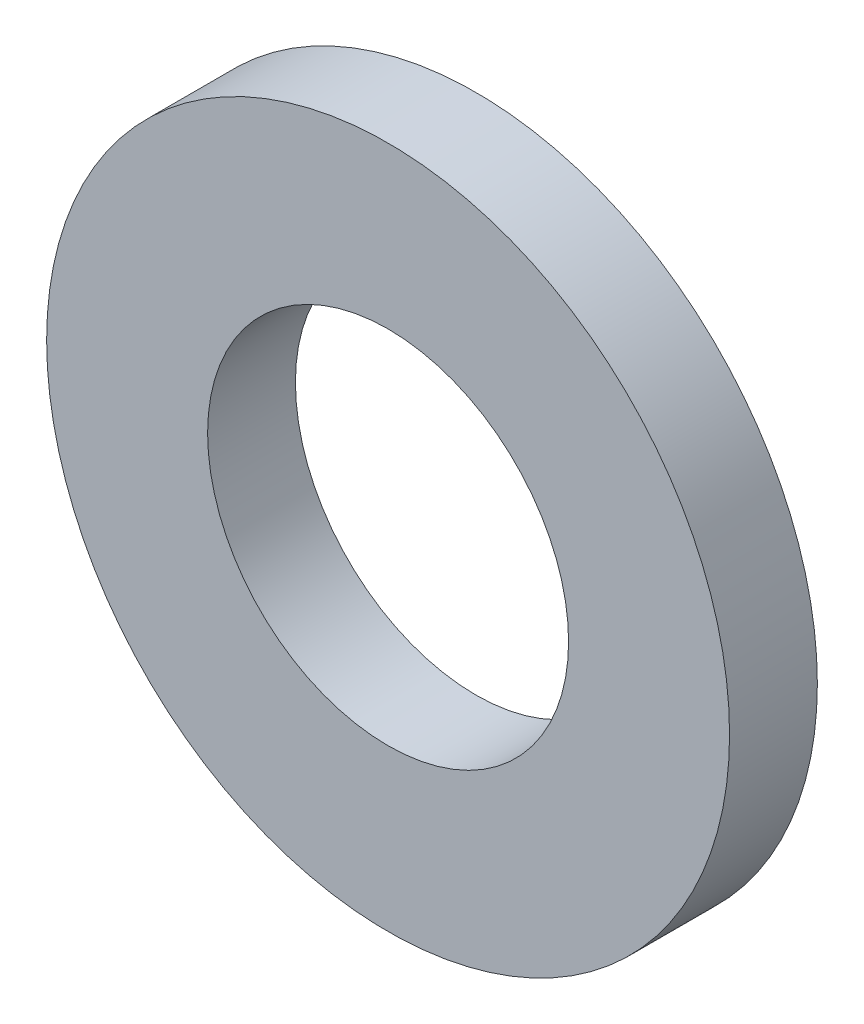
ISO-10303-21;
HEADER;
FILE_DESCRIPTION(('STEP AP214'),'2;1');
FILE_NAME('part.step','',(''),(''),'','','');
FILE_SCHEMA(('AUTOMOTIVE_DESIGN { 1 0 10303 214 1 1 1 1 }'));
ENDSEC;
DATA;
#1=APPLICATION_CONTEXT('core data for automotive mechanical design processes');
#2=APPLICATION_PROTOCOL_DEFINITION('international standard','automotive_design',2000,#1);
#3=PRODUCT_CONTEXT('',#1,'mechanical');
#4=PRODUCT('Part','Part','',(#3));
#5=PRODUCT_RELATED_PRODUCT_CATEGORY('part','',(#4));
#6=PRODUCT_DEFINITION_FORMATION('','',#4);
#7=PRODUCT_DEFINITION_CONTEXT('part definition',#1,'design');
#8=PRODUCT_DEFINITION('design','',#6,#7);
#9=PRODUCT_DEFINITION_SHAPE('','',#8);
#10=(LENGTH_UNIT() NAMED_UNIT(*) SI_UNIT(.MILLI.,.METRE.));
#11=(NAMED_UNIT(*) PLANE_ANGLE_UNIT() SI_UNIT($,.RADIAN.));
#12=(NAMED_UNIT(*) SI_UNIT($,.STERADIAN.) SOLID_ANGLE_UNIT());
#13=UNCERTAINTY_MEASURE_WITH_UNIT(LENGTH_MEASURE(1.E-05),#10,'distance_accuracy_value','');
#14=(GEOMETRIC_REPRESENTATION_CONTEXT(3) GLOBAL_UNCERTAINTY_ASSIGNED_CONTEXT((#13)) GLOBAL_UNIT_ASSIGNED_CONTEXT((#10,
#11,#12)) REPRESENTATION_CONTEXT('',''));
#15=CARTESIAN_POINT('',(0.,0.,0.));
#16=DIRECTION('',(0.,0.,1.));
#17=DIRECTION('',(1.,0.,0.));
#18=AXIS2_PLACEMENT_3D('',#15,#16,#17);
#19=CARTESIAN_POINT('',(0.,0.,1.8));
#20=DIRECTION('',(0.,0.,1.));
#21=DIRECTION('',(1.,0.,0.));
#22=AXIS2_PLACEMENT_3D('',#19,#20,#21);
#23=PLANE('',#22);
#24=CARTESIAN_POINT('',(0.,0.,1.8));
#25=DIRECTION('',(0.,0.,1.));
#26=DIRECTION('',(1.,0.,0.));
#27=AXIS2_PLACEMENT_3D('',#24,#25,#26);
#28=CIRCLE('',#27,7.);
#29=CARTESIAN_POINT('',(7.,0.,1.8));
#30=VERTEX_POINT('',#29);
#31=EDGE_CURVE('E10',#30,#30,#28,.T.);
#32=ORIENTED_EDGE('',*,*,#31,.T.);
#33=EDGE_LOOP('',(#32));
#34=FACE_BOUND('',#33,.T.);
#35=CARTESIAN_POINT('',(0.,0.,1.8));
#36=DIRECTION('',(0.,0.,1.));
#37=DIRECTION('',(1.,0.,0.));
#38=AXIS2_PLACEMENT_3D('',#35,#36,#37);
#39=CIRCLE('',#38,3.7);
#40=CARTESIAN_POINT('',(3.7,0.,1.8));
#41=VERTEX_POINT('',#40);
#42=EDGE_CURVE('E53',#41,#41,#39,.T.);
#43=ORIENTED_EDGE('',*,*,#42,.F.);
#44=EDGE_LOOP('',(#43));
#45=FACE_BOUND('',#44,.T.);
#46=ADVANCED_FACE('F39',(#34,#45),#23,.T.);
#47=CARTESIAN_POINT('',(0.,0.,0.));
#48=DIRECTION('',(0.,0.,1.));
#49=DIRECTION('',(1.,0.,0.));
#50=AXIS2_PLACEMENT_3D('',#47,#48,#49);
#51=PLANE('',#50);
#52=CARTESIAN_POINT('',(0.,0.,0.));
#53=DIRECTION('',(0.,0.,1.));
#54=DIRECTION('',(1.,0.,0.));
#55=AXIS2_PLACEMENT_3D('',#52,#53,#54);
#56=CIRCLE('',#55,7.);
#57=CARTESIAN_POINT('',(7.,0.,0.));
#58=VERTEX_POINT('',#57);
#59=EDGE_CURVE('E43',#58,#58,#56,.T.);
#60=ORIENTED_EDGE('',*,*,#59,.F.);
#61=EDGE_LOOP('',(#60));
#62=FACE_BOUND('',#61,.T.);
#63=CARTESIAN_POINT('',(0.,0.,0.));
#64=DIRECTION('',(0.,0.,1.));
#65=DIRECTION('',(1.,0.,0.));
#66=AXIS2_PLACEMENT_3D('',#63,#64,#65);
#67=CIRCLE('',#66,3.7);
#68=CARTESIAN_POINT('',(3.7,0.,0.));
#69=VERTEX_POINT('',#68);
#70=EDGE_CURVE('E55',#69,#69,#67,.T.);
#71=ORIENTED_EDGE('',*,*,#70,.T.);
#72=EDGE_LOOP('',(#71));
#73=FACE_BOUND('',#72,.T.);
#74=ADVANCED_FACE('F68',(#62,#73),#51,.F.);
#75=CARTESIAN_POINT('',(0.,0.,1.8));
#76=DIRECTION('',(0.,0.,-1.));
#77=DIRECTION('',(-1.,0.,0.));
#78=AXIS2_PLACEMENT_3D('',#75,#76,#77);
#79=CYLINDRICAL_SURFACE('',#78,7.);
#80=ORIENTED_EDGE('',*,*,#31,.F.);
#81=EDGE_LOOP('',(#80));
#82=FACE_BOUND('',#81,.T.);
#83=ORIENTED_EDGE('',*,*,#59,.T.);
#84=EDGE_LOOP('',(#83));
#85=FACE_BOUND('',#84,.T.);
#86=ADVANCED_FACE('F41',(#82,#85),#79,.T.);
#87=CARTESIAN_POINT('',(0.,0.,1.8));
#88=DIRECTION('',(0.,0.,-1.));
#89=DIRECTION('',(-1.,0.,0.));
#90=AXIS2_PLACEMENT_3D('',#87,#88,#89);
#91=CYLINDRICAL_SURFACE('',#90,3.7);
#92=ORIENTED_EDGE('',*,*,#42,.T.);
#93=EDGE_LOOP('',(#92));
#94=FACE_BOUND('',#93,.T.);
#95=ORIENTED_EDGE('',*,*,#70,.F.);
#96=EDGE_LOOP('',(#95));
#97=FACE_BOUND('',#96,.T.);
#98=ADVANCED_FACE('F64',(#94,#97),#91,.F.);
#99=CLOSED_SHELL('',(#46,#74,#86,#98));
#100=MANIFOLD_SOLID_BREP('B2',#99);
#101=ADVANCED_BREP_SHAPE_REPRESENTATION('',(#18,#100),#14);
#102=SHAPE_DEFINITION_REPRESENTATION(#9,#101);
ENDSEC;
END-ISO-10303-21;
